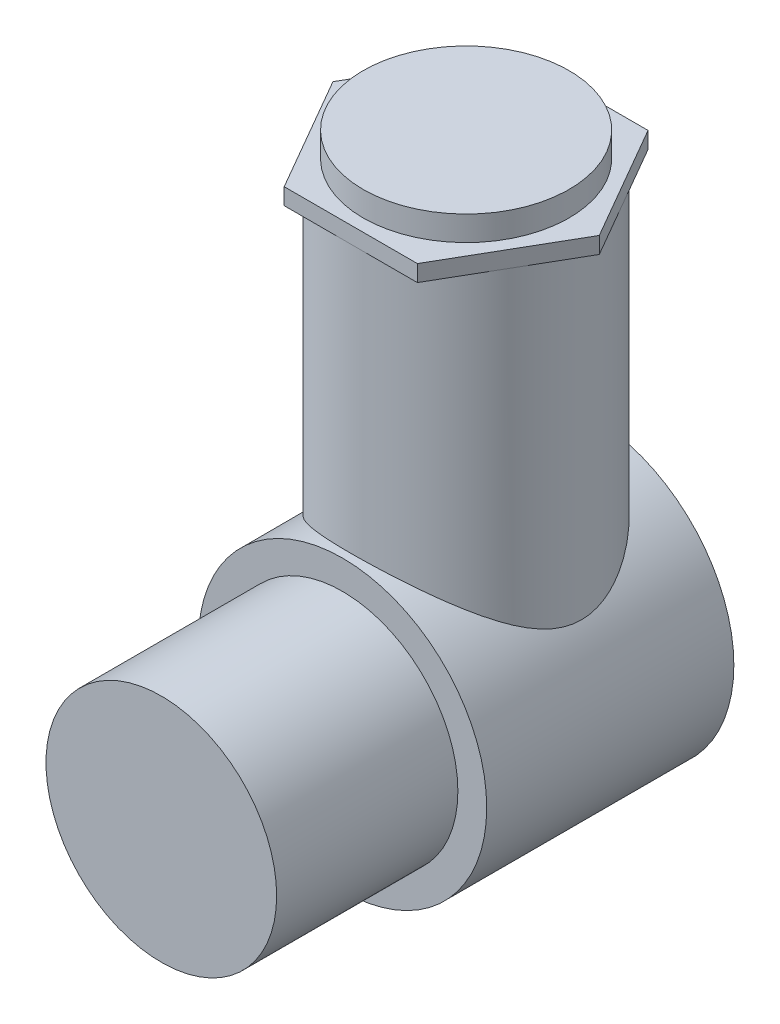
ISO-10303-21;
HEADER;
FILE_DESCRIPTION(('STEP AP214'),'2;1');
FILE_NAME('part.step','',(''),(''),'','','');
FILE_SCHEMA(('AUTOMOTIVE_DESIGN { 1 0 10303 214 1 1 1 1 }'));
ENDSEC;
DATA;
#1=APPLICATION_CONTEXT('core data for automotive mechanical design processes');
#2=APPLICATION_PROTOCOL_DEFINITION('international standard','automotive_design',2000,#1);
#3=PRODUCT_CONTEXT('',#1,'mechanical');
#4=PRODUCT('Part','Part','',(#3));
#5=PRODUCT_RELATED_PRODUCT_CATEGORY('part','',(#4));
#6=PRODUCT_DEFINITION_FORMATION('','',#4);
#7=PRODUCT_DEFINITION_CONTEXT('part definition',#1,'design');
#8=PRODUCT_DEFINITION('design','',#6,#7);
#9=PRODUCT_DEFINITION_SHAPE('','',#8);
#10=(LENGTH_UNIT() NAMED_UNIT(*) SI_UNIT(.MILLI.,.METRE.));
#11=(NAMED_UNIT(*) PLANE_ANGLE_UNIT() SI_UNIT($,.RADIAN.));
#12=(NAMED_UNIT(*) SI_UNIT($,.STERADIAN.) SOLID_ANGLE_UNIT());
#13=UNCERTAINTY_MEASURE_WITH_UNIT(LENGTH_MEASURE(1.E-05),#10,'distance_accuracy_value','');
#14=(GEOMETRIC_REPRESENTATION_CONTEXT(3) GLOBAL_UNCERTAINTY_ASSIGNED_CONTEXT((#13)) GLOBAL_UNIT_ASSIGNED_CONTEXT((#10,
#11,#12)) REPRESENTATION_CONTEXT('',''));
#15=CARTESIAN_POINT('',(0.,0.,0.));
#16=DIRECTION('',(0.,0.,1.));
#17=DIRECTION('',(1.,0.,0.));
#18=AXIS2_PLACEMENT_3D('',#15,#16,#17);
#19=CARTESIAN_POINT('',(0.,0.,150.));
#20=DIRECTION('',(0.,0.,-1.));
#21=DIRECTION('',(-1.,0.,0.));
#22=AXIS2_PLACEMENT_3D('',#19,#20,#21);
#23=CYLINDRICAL_SURFACE('',#22,175.);
#24=CARTESIAN_POINT('',(0.,0.,150.));
#25=DIRECTION('',(0.,0.,1.));
#26=DIRECTION('',(1.,0.,0.));
#27=AXIS2_PLACEMENT_3D('',#24,#25,#26);
#28=CIRCLE('',#27,175.);
#29=CARTESIAN_POINT('',(175.,0.,150.));
#30=VERTEX_POINT('',#29);
#31=EDGE_CURVE('E155',#30,#30,#28,.T.);
#32=ORIENTED_EDGE('',*,*,#31,.F.);
#33=EDGE_LOOP('',(#32));
#34=FACE_BOUND('',#33,.T.);
#35=CARTESIAN_POINT('',(0.,0.,-150.));
#36=DIRECTION('',(0.,0.,1.));
#37=DIRECTION('',(1.,0.,0.));
#38=AXIS2_PLACEMENT_3D('',#35,#36,#37);
#39=CIRCLE('',#38,175.);
#40=CARTESIAN_POINT('',(175.,0.,-150.));
#41=VERTEX_POINT('',#40);
#42=EDGE_CURVE('E151',#41,#41,#39,.T.);
#43=ORIENTED_EDGE('',*,*,#42,.T.);
#44=EDGE_LOOP('',(#43));
#45=FACE_BOUND('',#44,.T.);
#46=CARTESIAN_POINT('',(0.,175.,-140.));
#47=CARTESIAN_POINT('',(-1.68080300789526,174.999998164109,-139.999998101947));
#48=CARTESIAN_POINT('',(-3.36167422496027,174.975771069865,-139.969717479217));
#49=CARTESIAN_POINT('',(-6.72004292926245,174.878997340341,-139.848721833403));
#50=CARTESIAN_POINT('',(-8.39753991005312,174.806443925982,-139.757998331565));
#51=CARTESIAN_POINT('',(-11.7462356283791,174.61340139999,-139.51646936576));
#52=CARTESIAN_POINT('',(-13.4174310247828,174.492889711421,-139.365635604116));
#53=CARTESIAN_POINT('',(-16.7492251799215,174.204648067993,-139.004572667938));
#54=CARTESIAN_POINT('',(-18.4098243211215,174.036919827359,-138.794345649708));
#55=CARTESIAN_POINT('',(-21.7203796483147,173.654849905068,-138.314959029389));
#56=CARTESIAN_POINT('',(-23.3703092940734,173.440419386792,-138.04568710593));
#57=CARTESIAN_POINT('',(-26.6531920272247,172.966349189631,-137.449592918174));
#58=CARTESIAN_POINT('',(-28.2861449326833,172.706709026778,-137.122770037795));
#59=CARTESIAN_POINT('',(-31.53193351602,172.143689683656,-136.412963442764));
#60=CARTESIAN_POINT('',(-33.1447718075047,171.84031625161,-136.02998710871));
#61=CARTESIAN_POINT('',(-36.3478712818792,171.191420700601,-135.209339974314));
#62=CARTESIAN_POINT('',(-37.9381325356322,170.845898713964,-134.771669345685));
#63=CARTESIAN_POINT('',(-41.0834344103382,170.116844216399,-133.846260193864));
#64=CARTESIAN_POINT('',(-42.6386364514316,169.733572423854,-133.358864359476));
#65=CARTESIAN_POINT('',(-45.7223867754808,168.92898761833,-132.333306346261));
#66=CARTESIAN_POINT('',(-47.250932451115,168.507670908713,-131.79513923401));
#67=CARTESIAN_POINT('',(-50.2791715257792,167.62902571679,-130.669865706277));
#68=CARTESIAN_POINT('',(-51.7788679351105,167.171701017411,-130.082764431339));
#69=CARTESIAN_POINT('',(-54.7480602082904,166.222980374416,-128.861271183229));
#70=CARTESIAN_POINT('',(-56.2175534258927,165.731581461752,-128.226875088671));
#71=CARTESIAN_POINT('',(-59.1243339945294,164.71697581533,-126.912790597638));
#72=CARTESIAN_POINT('',(-60.561631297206,164.193779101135,-126.233116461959));
#73=CARTESIAN_POINT('',(-63.4034220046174,163.117487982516,-124.829954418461));
#74=CARTESIAN_POINT('',(-64.8079124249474,162.564390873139,-124.106462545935));
#75=CARTESIAN_POINT('',(-67.5830067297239,161.430430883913,-122.61735982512));
#76=CARTESIAN_POINT('',(-68.9536093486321,160.849566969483,-121.851747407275));
#77=CARTESIAN_POINT('',(-71.6600682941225,159.66220139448,-120.280021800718));
#78=CARTESIAN_POINT('',(-72.9959233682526,159.055698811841,-119.473907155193));
#79=CARTESIAN_POINT('',(-76.0913887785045,157.603787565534,-117.535094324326));
#80=CARTESIAN_POINT('',(-77.8365284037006,156.748747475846,-116.386443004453));
#81=CARTESIAN_POINT('',(-81.2611345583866,155.00104585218,-114.021746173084));
#82=CARTESIAN_POINT('',(-82.9405967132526,154.10838182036,-112.805696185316));
#83=CARTESIAN_POINT('',(-86.2333082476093,152.290361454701,-110.309049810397));
#84=CARTESIAN_POINT('',(-87.8465399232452,151.364996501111,-109.028436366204));
#85=CARTESIAN_POINT('',(-91.0056433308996,149.486954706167,-106.40576831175));
#86=CARTESIAN_POINT('',(-92.5515161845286,148.534278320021,-105.06371472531));
#87=CARTESIAN_POINT('',(-95.5794864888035,146.604207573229,-102.316915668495));
#88=CARTESIAN_POINT('',(-97.0614048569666,145.626754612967,-100.912014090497));
#89=CARTESIAN_POINT('',(-99.9567992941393,143.654816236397,-98.0448335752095));
#90=CARTESIAN_POINT('',(-101.370275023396,142.660330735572,-96.5825543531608));
#91=CARTESIAN_POINT('',(-104.128324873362,140.659851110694,-93.6024225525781));
#92=CARTESIAN_POINT('',(-105.472907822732,139.653858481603,-92.0845771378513));
#93=CARTESIAN_POINT('',(-108.093069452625,137.635833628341,-88.9943375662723));
#94=CARTESIAN_POINT('',(-109.368648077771,136.623801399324,-87.4219433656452));
#95=CARTESIAN_POINT('',(-111.869836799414,134.583745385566,-84.198375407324));
#96=CARTESIAN_POINT('',(-113.094352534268,133.555719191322,-82.5463538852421));
#97=CARTESIAN_POINT('',(-115.471235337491,131.506107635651,-79.1872914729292));
#98=CARTESIAN_POINT('',(-116.623601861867,130.484522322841,-77.4802501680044));
#99=CARTESIAN_POINT('',(-118.855725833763,128.454633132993,-74.0106281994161));
#100=CARTESIAN_POINT('',(-119.935458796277,127.446333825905,-72.2480290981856));
#101=CARTESIAN_POINT('',(-122.020717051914,125.451291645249,-68.6675802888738));
#102=CARTESIAN_POINT('',(-123.026243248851,124.464548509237,-66.8497312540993));
#103=CARTESIAN_POINT('',(-124.958865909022,122.52408614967,-63.1632898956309));
#104=CARTESIAN_POINT('',(-125.886169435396,121.570283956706,-61.2948500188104));
#105=CARTESIAN_POINT('',(-127.663361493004,119.702663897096,-57.5017634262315));
#106=CARTESIAN_POINT('',(-128.513246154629,118.788848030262,-55.5771139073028));
#107=CARTESIAN_POINT('',(-130.132278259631,117.012960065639,-51.6725606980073));
#108=CARTESIAN_POINT('',(-130.901482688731,116.150851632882,-49.6926972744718));
#109=CARTESIAN_POINT('',(-132.356330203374,114.490263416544,-45.676710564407));
#110=CARTESIAN_POINT('',(-133.04198830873,113.69177220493,-43.6405974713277));
#111=CARTESIAN_POINT('',(-134.422147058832,112.057997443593,-39.2028779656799));
#112=CARTESIAN_POINT('',(-135.10255475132,111.23515288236,-36.7922501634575));
#113=CARTESIAN_POINT('',(-136.340408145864,109.714429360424,-31.9006744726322));
#114=CARTESIAN_POINT('',(-136.897873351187,109.016530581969,-29.4197378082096));
#115=CARTESIAN_POINT('',(-137.635338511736,108.081775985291,-25.654366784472));
#116=CARTESIAN_POINT('',(-137.86453674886,107.789094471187,-24.3931132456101));
#117=CARTESIAN_POINT('',(-138.289361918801,107.243517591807,-21.8564732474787));
#118=CARTESIAN_POINT('',(-138.4849923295,106.990618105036,-20.5810882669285));
#119=CARTESIAN_POINT('',(-138.84176494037,106.5272258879,-18.0177420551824));
#120=CARTESIAN_POINT('',(-139.00290467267,106.316736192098,-16.7297799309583));
#121=CARTESIAN_POINT('',(-139.289832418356,105.940542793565,-14.1433877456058));
#122=CARTESIAN_POINT('',(-139.415620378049,105.774839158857,-12.8449576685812));
#123=CARTESIAN_POINT('',(-139.632092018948,105.4889159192,-10.2282810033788));
#124=CARTESIAN_POINT('',(-139.722450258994,105.369118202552,-8.90996117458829));
#125=CARTESIAN_POINT('',(-139.865885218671,105.178649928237,-6.26774170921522));
#126=CARTESIAN_POINT('',(-139.918961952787,105.107979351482,-4.94384207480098));
#127=CARTESIAN_POINT('',(-139.987491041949,105.016692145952,-2.2933930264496));
#128=CARTESIAN_POINT('',(-140.002944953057,104.996073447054,-0.966843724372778));
#129=CARTESIAN_POINT('',(-139.99613153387,105.005157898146,1.68598659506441));
#130=CARTESIAN_POINT('',(-139.973864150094,105.034861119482,3.01226761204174));
#131=CARTESIAN_POINT('',(-139.891724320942,105.144234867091,5.66254597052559));
#132=CARTESIAN_POINT('',(-139.83182491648,105.223941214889,6.98654099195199));
#133=CARTESIAN_POINT('',(-139.674780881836,105.432312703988,9.62843162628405));
#134=CARTESIAN_POINT('',(-139.577636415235,105.560977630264,10.9463272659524));
#135=CARTESIAN_POINT('',(-139.346685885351,105.86565841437,13.5735101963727));
#136=CARTESIAN_POINT('',(-139.212876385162,106.041678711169,14.882796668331));
#137=CARTESIAN_POINT('',(-138.909365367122,106.438952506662,17.4903193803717));
#138=CARTESIAN_POINT('',(-138.739662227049,106.660208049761,18.7885551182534));
#139=CARTESIAN_POINT('',(-138.335979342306,107.183405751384,21.5739331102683));
#140=CARTESIAN_POINT('',(-138.09609811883,107.492554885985,23.0588696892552));
#141=CARTESIAN_POINT('',(-137.571055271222,108.163700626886,26.0086403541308));
#142=CARTESIAN_POINT('',(-137.285891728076,108.525699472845,27.4734735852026));
#143=CARTESIAN_POINT('',(-136.671839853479,109.297993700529,30.3811831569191));
#144=CARTESIAN_POINT('',(-136.342947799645,109.708293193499,31.82405761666));
#145=CARTESIAN_POINT('',(-135.643011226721,110.572523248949,34.6863783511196));
#146=CARTESIAN_POINT('',(-135.271961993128,111.02645869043,36.1058219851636));
#147=CARTESIAN_POINT('',(-134.096026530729,112.448966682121,40.333948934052));
#148=CARTESIAN_POINT('',(-133.22970975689,113.476509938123,43.1060520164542));
#149=CARTESIAN_POINT('',(-131.344544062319,115.65328781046,48.5479943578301));
#150=CARTESIAN_POINT('',(-130.325682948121,116.802532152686,51.2178254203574));
#151=CARTESIAN_POINT('',(-128.42141115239,118.888175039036,55.7890107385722));
#152=CARTESIAN_POINT('',(-127.567981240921,119.804352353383,57.7130902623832));
#153=CARTESIAN_POINT('',(-125.783502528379,121.676548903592,61.505304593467));
#154=CARTESIAN_POINT('',(-124.852445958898,122.632572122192,63.3734337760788));
#155=CARTESIAN_POINT('',(-122.914525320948,124.574887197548,67.0548144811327));
#156=CARTESIAN_POINT('',(-121.907632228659,125.56119055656,68.8680446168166));
#157=CARTESIAN_POINT('',(-119.819938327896,127.554952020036,72.4393565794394));
#158=CARTESIAN_POINT('',(-118.739139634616,128.562409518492,74.1974399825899));
#159=CARTESIAN_POINT('',(-116.503454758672,130.591833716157,77.6607892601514));
#160=CARTESIAN_POINT('',(-115.348483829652,131.613815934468,79.3659912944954));
#161=CARTESIAN_POINT('',(-112.966394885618,133.663993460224,82.7213806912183));
#162=CARTESIAN_POINT('',(-111.739276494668,134.692188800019,84.3715677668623));
#163=CARTESIAN_POINT('',(-109.213677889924,136.748029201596,87.6161990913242));
#164=CARTESIAN_POINT('',(-107.91520968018,137.775674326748,89.2106526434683));
#165=CARTESIAN_POINT('',(-105.247124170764,139.824432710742,92.3432496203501));
#166=CARTESIAN_POINT('',(-103.877506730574,140.845545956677,93.8813929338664));
#167=CARTESIAN_POINT('',(-101.029751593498,142.902612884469,96.940562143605));
#168=CARTESIAN_POINT('',(-99.5496889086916,143.938230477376,98.4600235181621));
#169=CARTESIAN_POINT('',(-96.5151774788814,145.990326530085,101.436370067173));
#170=CARTESIAN_POINT('',(-94.9607282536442,147.006804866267,102.893254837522));
#171=CARTESIAN_POINT('',(-91.7775386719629,149.014849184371,105.742359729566));
#172=CARTESIAN_POINT('',(-90.1487848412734,150.006410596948,107.134568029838));
#173=CARTESIAN_POINT('',(-86.8178254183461,151.958519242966,109.851189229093));
#174=CARTESIAN_POINT('',(-85.1156216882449,152.919067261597,111.175603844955));
#175=CARTESIAN_POINT('',(-81.6424328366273,154.801181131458,113.75049796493));
#176=CARTESIAN_POINT('',(-79.8716114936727,155.722830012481,115.001137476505));
#177=CARTESIAN_POINT('',(-76.258671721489,157.523613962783,117.42806607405));
#178=CARTESIAN_POINT('',(-74.4165515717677,158.402748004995,118.604353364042));
#179=CARTESIAN_POINT('',(-70.6633639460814,160.112272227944,120.878042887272));
#180=CARTESIAN_POINT('',(-68.7523224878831,160.942680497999,121.975474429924));
#181=CARTESIAN_POINT('',(-64.8628910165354,162.549165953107,124.087474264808));
#182=CARTESIAN_POINT('',(-62.8845074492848,163.325248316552,125.102050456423));
#183=CARTESIAN_POINT('',(-59.4416008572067,164.602644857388,126.764452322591));
#184=CARTESIAN_POINT('',(-57.9929296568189,165.118790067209,127.433836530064));
#185=CARTESIAN_POINT('',(-55.0641143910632,166.118443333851,128.726474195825));
#186=CARTESIAN_POINT('',(-53.5839717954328,166.601952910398,129.349729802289));
#187=CARTESIAN_POINT('',(-50.5938587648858,167.534216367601,130.548287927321));
#188=CARTESIAN_POINT('',(-49.083892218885,167.982974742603,131.123596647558));
#189=CARTESIAN_POINT('',(-46.0356301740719,168.843800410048,132.224607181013));
#190=CARTESIAN_POINT('',(-44.4973343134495,169.255867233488,132.75030836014));
#191=CARTESIAN_POINT('',(-41.3952087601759,170.041157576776,133.750106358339));
#192=CARTESIAN_POINT('',(-39.8313929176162,170.41440140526,134.224230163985));
#193=CARTESIAN_POINT('',(-36.6796488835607,171.12045842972,135.119528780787));
#194=CARTESIAN_POINT('',(-35.0917207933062,171.453271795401,135.540703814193));
#195=CARTESIAN_POINT('',(-31.8941273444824,172.076779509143,136.328559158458));
#196=CARTESIAN_POINT('',(-30.2844610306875,172.367471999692,136.695237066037));
#197=CARTESIAN_POINT('',(-27.0461508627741,172.905175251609,137.372639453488));
#198=CARTESIAN_POINT('',(-25.4175069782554,173.152185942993,137.683363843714));
#199=CARTESIAN_POINT('',(-22.1354889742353,173.602356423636,138.249078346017));
#200=CARTESIAN_POINT('',(-20.4820295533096,173.805276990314,138.503764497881));
#201=CARTESIAN_POINT('',(-17.1620513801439,174.16443889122,138.954201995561));
#202=CARTESIAN_POINT('',(-15.495532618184,174.320680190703,139.149953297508));
#203=CARTESIAN_POINT('',(-12.1527672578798,174.585570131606,139.481652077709));
#204=CARTESIAN_POINT('',(-10.4765205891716,174.694218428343,139.617599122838));
#205=CARTESIAN_POINT('',(-7.11779098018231,174.863273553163,139.82906877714));
#206=CARTESIAN_POINT('',(-5.43530804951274,174.923680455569,139.904591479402));
#207=CARTESIAN_POINT('',(-2.06790525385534,174.995884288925,139.994857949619));
#208=CARTESIAN_POINT('',(-0.382985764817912,175.007688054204,140.0096102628));
#209=CARTESIAN_POINT('',(2.98593306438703,174.982632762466,139.978290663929));
#210=CARTESIAN_POINT('',(4.66993240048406,174.945773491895,139.932218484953));
#211=CARTESIAN_POINT('',(8.03332891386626,174.823617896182,139.779467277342));
#212=CARTESIAN_POINT('',(9.71272631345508,174.738323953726,139.672791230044));
#213=CARTESIAN_POINT('',(13.0634643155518,174.519811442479,139.399323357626));
#214=CARTESIAN_POINT('',(14.7348050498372,174.386593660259,139.232532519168));
#215=CARTESIAN_POINT('',(17.9307163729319,174.085761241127,138.855551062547));
#216=CARTESIAN_POINT('',(19.456182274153,173.921819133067,138.649985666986));
#217=CARTESIAN_POINT('',(22.4949334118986,173.554948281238,138.18950554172));
#218=CARTESIAN_POINT('',(24.0082186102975,173.35201941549,137.934590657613));
#219=CARTESIAN_POINT('',(27.0200742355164,172.908162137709,137.376348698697));
#220=CARTESIAN_POINT('',(28.518645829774,172.667236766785,137.073025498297));
#221=CARTESIAN_POINT('',(31.498964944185,172.148491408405,136.418997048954));
#222=CARTESIAN_POINT('',(32.9807123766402,171.870671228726,136.068291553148));
#223=CARTESIAN_POINT('',(35.9255061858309,171.279344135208,135.320604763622));
#224=CARTESIAN_POINT('',(37.3885498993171,170.965832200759,134.923616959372));
#225=CARTESIAN_POINT('',(40.2939365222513,170.304487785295,134.084619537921));
#226=CARTESIAN_POINT('',(41.7362778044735,169.956652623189,133.642606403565));
#227=CARTESIAN_POINT('',(44.598365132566,169.228148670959,132.714915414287));
#228=CARTESIAN_POINT('',(46.0181121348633,168.847481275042,132.229239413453));
#229=CARTESIAN_POINT('',(48.8336490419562,168.054794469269,131.21552406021));
#230=CARTESIAN_POINT('',(50.2294368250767,167.642772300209,130.687480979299));
#231=CARTESIAN_POINT('',(53.0808895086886,166.762646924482,129.556606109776));
#232=CARTESIAN_POINT('',(54.53493934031,166.292652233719,128.951170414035));
#233=CARTESIAN_POINT('',(57.4130042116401,165.32106571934,127.695781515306));
#234=CARTESIAN_POINT('',(58.8370165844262,164.819471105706,127.04582438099));
#235=CARTESIAN_POINT('',(63.061882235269,163.270307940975,125.031720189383));
#236=CARTESIAN_POINT('',(65.8161354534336,162.178182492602,123.603112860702));
#237=CARTESIAN_POINT('',(71.1910277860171,159.891743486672,120.587462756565));
#238=CARTESIAN_POINT('',(73.8116828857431,158.697442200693,119.000439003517));
#239=CARTESIAN_POINT('',(78.9151973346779,156.22238895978,115.679129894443));
#240=CARTESIAN_POINT('',(81.3980487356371,154.941632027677,113.944836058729));
#241=CARTESIAN_POINT('',(86.679082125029,152.060563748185,109.998021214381));
#242=CARTESIAN_POINT('',(89.4480661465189,150.445634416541,107.757096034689));
#243=CARTESIAN_POINT('',(94.7837127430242,147.142422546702,103.095107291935));
#244=CARTESIAN_POINT('',(97.3503521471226,145.454131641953,100.674023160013));
#245=CARTESIAN_POINT('',(101.04998778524,142.885144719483,96.9123528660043));
#246=CARTESIAN_POINT('',(102.259787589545,142.021447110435,95.6348447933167));
#247=CARTESIAN_POINT('',(104.627883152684,140.285994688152,93.0381307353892));
#248=CARTESIAN_POINT('',(105.786179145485,139.414239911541,91.7189249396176));
#249=CARTESIAN_POINT('',(108.051018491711,137.666349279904,89.039623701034));
#250=CARTESIAN_POINT('',(109.157561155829,136.790213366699,87.6795277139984));
#251=CARTESIAN_POINT('',(111.318646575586,135.037382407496,84.9189711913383));
#252=CARTESIAN_POINT('',(112.37318877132,134.160687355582,83.518510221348));
#253=CARTESIAN_POINT('',(114.649528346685,132.223938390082,80.3742176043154));
#254=CARTESIAN_POINT('',(115.858966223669,131.16469914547,78.6209125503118));
#255=CARTESIAN_POINT('',(118.199953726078,129.059092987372,75.0554421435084));
#256=CARTESIAN_POINT('',(119.331500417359,128.01272656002,73.2432745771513));
#257=CARTESIAN_POINT('',(121.516068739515,125.940907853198,69.5588557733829));
#258=CARTESIAN_POINT('',(122.569046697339,124.915467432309,67.686571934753));
#259=CARTESIAN_POINT('',(124.594080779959,122.895727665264,63.8823773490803));
#260=CARTESIAN_POINT('',(125.566138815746,121.901427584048,61.950468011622));
#261=CARTESIAN_POINT('',(127.423859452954,119.958161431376,58.0331176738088));
#262=CARTESIAN_POINT('',(128.309811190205,119.009049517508,56.0478865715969));
#263=CARTESIAN_POINT('',(129.996274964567,117.164543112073,52.0167508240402));
#264=CARTESIAN_POINT('',(130.79678110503,116.269152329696,49.9708420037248));
#265=CARTESIAN_POINT('',(132.307814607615,114.546730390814,45.8204505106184));
#266=CARTESIAN_POINT('',(133.01843406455,113.719629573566,43.7160305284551));
#267=CARTESIAN_POINT('',(134.345978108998,112.148188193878,39.4480909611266));
#268=CARTESIAN_POINT('',(134.962926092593,111.403826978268,37.2845862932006));
#269=CARTESIAN_POINT('',(136.141529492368,109.960982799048,32.7325797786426));
#270=CARTESIAN_POINT('',(136.695368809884,109.270339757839,30.3395098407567));
#271=CARTESIAN_POINT('',(137.434861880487,108.336587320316,26.7055796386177));
#272=CARTESIAN_POINT('',(137.666154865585,108.042363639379,25.4868400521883));
#273=CARTESIAN_POINT('',(138.097453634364,107.490539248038,23.035651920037));
#274=CARTESIAN_POINT('',(138.297462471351,107.232934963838,21.8032047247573));
#275=CARTESIAN_POINT('',(138.664944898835,106.757309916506,19.3285945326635));
#276=CARTESIAN_POINT('',(138.832485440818,106.539207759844,18.0864571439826));
#277=CARTESIAN_POINT('',(139.134734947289,106.144182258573,15.5917908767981));
#278=CARTESIAN_POINT('',(139.269447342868,105.967254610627,14.3392630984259));
#279=CARTESIAN_POINT('',(139.505369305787,105.656471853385,11.8256294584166));
#280=CARTESIAN_POINT('',(139.606576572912,105.522619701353,10.5645230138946));
#281=CARTESIAN_POINT('',(139.774914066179,105.299539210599,8.03608687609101));
#282=CARTESIAN_POINT('',(139.842044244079,105.210310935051,6.76875717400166));
#283=CARTESIAN_POINT('',(139.942109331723,105.077176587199,4.2233971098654));
#284=CARTESIAN_POINT('',(139.974855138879,105.033521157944,2.94534613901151));
#285=CARTESIAN_POINT('',(140.005301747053,104.992933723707,0.388083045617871));
#286=CARTESIAN_POINT('',(140.003002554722,104.996001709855,-0.891129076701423));
#287=CARTESIAN_POINT('',(139.963373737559,105.048822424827,-3.4480120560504));
#288=CARTESIAN_POINT('',(139.926044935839,105.098574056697,-4.72568294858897));
#289=CARTESIAN_POINT('',(139.816583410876,105.244150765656,-7.27689534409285));
#290=CARTESIAN_POINT('',(139.744450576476,105.339975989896,-8.5504368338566));
#291=CARTESIAN_POINT('',(139.56568201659,105.576713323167,-11.0926238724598));
#292=CARTESIAN_POINT('',(139.458999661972,105.717686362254,-12.3612604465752));
#293=CARTESIAN_POINT('',(139.211756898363,106.043049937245,-14.8896007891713));
#294=CARTESIAN_POINT('',(139.071196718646,106.227440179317,-16.1493046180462));
#295=CARTESIAN_POINT('',(138.756912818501,106.637638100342,-18.6579008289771));
#296=CARTESIAN_POINT('',(138.583185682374,106.863450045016,-19.90679208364));
#297=CARTESIAN_POINT('',(138.2034067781,107.354154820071,-22.3919340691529));
#298=CARTESIAN_POINT('',(137.997353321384,107.619049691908,-23.6281841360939));
#299=CARTESIAN_POINT('',(137.492993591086,108.263044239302,-26.4236469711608));
#300=CARTESIAN_POINT('',(137.184882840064,108.653544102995,-27.9784852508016));
#301=CARTESIAN_POINT('',(136.519551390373,109.488342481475,-31.0628789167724));
#302=CARTESIAN_POINT('',(136.162327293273,109.9326447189,-32.592432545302));
#303=CARTESIAN_POINT('',(135.019556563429,111.338112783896,-37.1415422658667));
#304=CARTESIAN_POINT('',(134.162920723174,112.371827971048,-40.1214965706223));
#305=CARTESIAN_POINT('',(132.745650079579,114.035635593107,-44.5080209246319));
#306=CARTESIAN_POINT('',(132.250446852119,114.609927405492,-45.9581167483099));
#307=CARTESIAN_POINT('',(131.217368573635,115.791266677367,-48.8295946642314));
#308=CARTESIAN_POINT('',(130.679494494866,116.398313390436,-50.2509774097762));
#309=CARTESIAN_POINT('',(129.562397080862,117.640482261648,-53.0648387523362));
#310=CARTESIAN_POINT('',(128.983173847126,118.275604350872,-54.4573174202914));
#311=CARTESIAN_POINT('',(127.784444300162,119.569703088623,-57.2135842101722));
#312=CARTESIAN_POINT('',(127.164936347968,120.228680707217,-58.577371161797));
#313=CARTESIAN_POINT('',(125.596376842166,121.870254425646,-61.8891323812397));
#314=CARTESIAN_POINT('',(124.625392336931,122.863960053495,-63.8212593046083));
#315=CARTESIAN_POINT('',(122.602486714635,124.882635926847,-67.6259765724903));
#316=CARTESIAN_POINT('',(121.550558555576,125.907608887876,-69.4985617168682));
#317=CARTESIAN_POINT('',(119.367109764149,127.979525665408,-73.1852744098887));
#318=CARTESIAN_POINT('',(118.235561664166,129.026476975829,-74.9993814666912));
#319=CARTESIAN_POINT('',(115.894449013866,131.133354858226,-78.5686428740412));
#320=CARTESIAN_POINT('',(114.684886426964,132.193281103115,-80.3237987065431));
#321=CARTESIAN_POINT('',(112.187372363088,134.319341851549,-83.7767137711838));
#322=CARTESIAN_POINT('',(110.899347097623,135.385481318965,-85.4744165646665));
#323=CARTESIAN_POINT('',(108.246531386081,137.515753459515,-88.8100748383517));
#324=CARTESIAN_POINT('',(106.881740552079,138.579886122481,-90.4480300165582));
#325=CARTESIAN_POINT('',(104.07602174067,140.699226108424,-93.6628673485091));
#326=CARTESIAN_POINT('',(102.635105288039,141.75443475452,-95.2397586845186));
#327=CARTESIAN_POINT('',(99.6772758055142,143.849662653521,-98.3311597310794));
#328=CARTESIAN_POINT('',(98.1603627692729,144.889681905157,-99.8456694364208));
#329=CARTESIAN_POINT('',(95.0302616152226,146.961964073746,-102.829892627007));
#330=CARTESIAN_POINT('',(93.4160640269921,147.993941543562,-104.298746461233));
#331=CARTESIAN_POINT('',(90.1104254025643,150.029593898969,-107.167628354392));
#332=CARTESIAN_POINT('',(88.4189839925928,151.033268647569,-108.567656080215));
#333=CARTESIAN_POINT('',(84.9591637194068,153.006231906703,-111.29597869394));
#334=CARTESIAN_POINT('',(83.1907693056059,153.975513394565,-112.624258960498));
#335=CARTESIAN_POINT('',(79.5783457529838,155.873183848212,-115.205096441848));
#336=CARTESIAN_POINT('',(77.7343173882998,156.801573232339,-116.457654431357));
#337=CARTESIAN_POINT('',(73.9764950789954,158.608999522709,-118.880037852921));
#338=CARTESIAN_POINT('',(72.062878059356,159.488148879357,-120.050053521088));
#339=CARTESIAN_POINT('',(68.1636053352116,161.193209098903,-122.306158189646));
#340=CARTESIAN_POINT('',(66.1779474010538,162.019118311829,-123.392244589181));
#341=CARTESIAN_POINT('',(62.1383276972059,163.61093795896,-125.475056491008));
#342=CARTESIAN_POINT('',(60.0844016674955,164.376879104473,-126.471827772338));
#343=CARTESIAN_POINT('',(55.9108094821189,165.842912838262,-128.371478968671));
#344=CARTESIAN_POINT('',(53.7911515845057,166.543013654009,-129.274370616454));
#345=CARTESIAN_POINT('',(50.1932664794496,167.654204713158,-130.702189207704));
#346=CARTESIAN_POINT('',(48.7317803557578,168.084977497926,-131.254212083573));
#347=CARTESIAN_POINT('',(45.7825203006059,168.912124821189,-132.311808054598));
#348=CARTESIAN_POINT('',(44.29474757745,169.308500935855,-132.817383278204));
#349=CARTESIAN_POINT('',(41.2947290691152,170.065100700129,-133.78051897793));
#350=CARTESIAN_POINT('',(39.7824842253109,170.425325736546,-134.23808129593));
#351=CARTESIAN_POINT('',(36.7354378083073,171.107992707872,-135.103723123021));
#352=CARTESIAN_POINT('',(35.2006360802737,171.430434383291,-135.511802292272));
#353=CARTESIAN_POINT('',(32.1141671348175,172.035309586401,-136.276198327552));
#354=CARTESIAN_POINT('',(30.5625454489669,172.317831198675,-136.632629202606));
#355=CARTESIAN_POINT('',(27.4414914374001,172.842322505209,-137.293513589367));
#356=CARTESIAN_POINT('',(25.8720594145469,173.084292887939,-137.597967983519));
#357=CARTESIAN_POINT('',(22.7185435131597,173.526372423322,-138.15364725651));
#358=CARTESIAN_POINT('',(21.1344651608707,173.726496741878,-138.404891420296));
#359=CARTESIAN_POINT('',(17.9540323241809,174.083924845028,-138.853272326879));
#360=CARTESIAN_POINT('',(16.3576793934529,174.241233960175,-139.050415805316));
#361=CARTESIAN_POINT('',(13.5343266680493,174.480162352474,-139.349679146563));
#362=CARTESIAN_POINT('',(12.3092898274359,174.570883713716,-139.463245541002));
#363=CARTESIAN_POINT('',(9.85529393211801,174.72659870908,-139.658110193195));
#364=CARTESIAN_POINT('',(8.6263358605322,174.791598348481,-139.739415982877));
#365=CARTESIAN_POINT('',(6.16534044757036,174.895699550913,-139.869608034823));
#366=CARTESIAN_POINT('',(4.93330250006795,174.934795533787,-139.918487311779));
#367=CARTESIAN_POINT('',(2.46752218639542,174.986949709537,-139.983688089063));
#368=CARTESIAN_POINT('',(1.2337794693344,175.00000134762,-140.00000139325));
#369=CARTESIAN_POINT('',(0.,175.,-140.));
#370=B_SPLINE_CURVE_WITH_KNOTS('',3,(#46,#47,#48,#49,#50,#51,#52,#53,#54,#55,#56,#57,#58,#59,
#60,#61,#62,#63,#64,#65,#66,#67,#68,#69,#70,#71,#72,#73,#74,#75,#76,#77,#78,#79,#80,#81,#82,#83,
#84,#85,#86,#87,#88,#89,#90,#91,#92,#93,#94,#95,#96,#97,#98,#99,#100,#101,#102,#103,#104,#105,
#106,#107,#108,#109,#110,#111,#112,#113,#114,#115,#116,#117,#118,#119,#120,#121,#122,#123,#124,
#125,#126,#127,#128,#129,#130,#131,#132,#133,#134,#135,#136,#137,#138,#139,#140,#141,#142,#143,
#144,#145,#146,#147,#148,#149,#150,#151,#152,#153,#154,#155,#156,#157,#158,#159,#160,#161,#162,
#163,#164,#165,#166,#167,#168,#169,#170,#171,#172,#173,#174,#175,#176,#177,#178,#179,#180,#181,
#182,#183,#184,#185,#186,#187,#188,#189,#190,#191,#192,#193,#194,#195,#196,#197,#198,#199,#200,
#201,#202,#203,#204,#205,#206,#207,#208,#209,#210,#211,#212,#213,#214,#215,#216,#217,#218,#219,
#220,#221,#222,#223,#224,#225,#226,#227,#228,#229,#230,#231,#232,#233,#234,#235,#236,#237,#238,
#239,#240,#241,#242,#243,#244,#245,#246,#247,#248,#249,#250,#251,#252,#253,#254,#255,#256,#257,
#258,#259,#260,#261,#262,#263,#264,#265,#266,#267,#268,#269,#270,#271,#272,#273,#274,#275,#276,
#277,#278,#279,#280,#281,#282,#283,#284,#285,#286,#287,#288,#289,#290,#291,#292,#293,#294,#295,
#296,#297,#298,#299,#300,#301,#302,#303,#304,#305,#306,#307,#308,#309,#310,#311,#312,#313,#314,
#315,#316,#317,#318,#319,#320,#321,#322,#323,#324,#325,#326,#327,#328,#329,#330,#331,#332,#333,
#334,#335,#336,#337,#338,#339,#340,#341,#342,#343,#344,#345,#346,#347,#348,#349,#350,#351,#352,
#353,#354,#355,#356,#357,#358,#359,#360,#361,#362,#363,#364,#365,#366,#367,#368,#369),
.UNSPECIFIED.,.T.,.F.,(4,2,2,2,2,2,2,2,2,2,2,2,2,2,2,2,2,2,2,2,2,2,2,2,2,2,2,2,2,2,2,2,2,2,2,2,
2,2,2,2,2,2,2,2,2,2,2,2,2,2,2,2,2,2,2,2,2,2,2,2,2,2,2,2,2,2,2,2,2,2,2,2,2,2,2,2,2,2,2,2,2,2,2,2,
2,2,2,2,2,2,2,2,2,2,2,2,2,2,2,2,2,2,2,2,2,2,2,2,2,2,2,2,2,2,2,2,2,2,2,2,2,2,2,2,2,2,2,2,2,2,2,2,
2,2,2,2,2,2,2,2,2,2,2,2,2,2,2,2,2,2,2,2,2,2,2,2,2,2,2,2,2,4),(0.,5.04208097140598,
10.0848693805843,15.1300345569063,20.1750165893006,25.2296802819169,30.2843980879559,
35.3384521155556,40.3924902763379,45.4137899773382,50.4355780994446,55.4568393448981,
60.4785386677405,65.4986637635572,70.5192437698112,75.5400109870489,80.5609589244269,
87.3307845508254,94.1010603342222,100.873134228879,107.645095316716,114.434928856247,
121.224796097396,128.013791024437,134.802791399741,141.698034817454,148.593330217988,
155.490938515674,162.388462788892,169.26711482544,176.146110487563,183.020214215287,
189.89308029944,197.796597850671,205.698860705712,209.642636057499,213.586002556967,
217.52965111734,221.473305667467,225.452380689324,229.431454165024,233.41036306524,
237.389277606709,241.37104584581,245.352796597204,249.334920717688,253.317224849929,
257.922261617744,262.527493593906,267.133117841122,271.739257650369,280.971710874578,
290.204902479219,297.08939751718,303.974582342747,310.862415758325,317.750052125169,
324.645703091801,331.541389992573,338.435920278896,345.330464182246,352.409852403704,
359.489286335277,366.57000917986,373.650552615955,380.715127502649,387.779872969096,
394.841978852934,401.903410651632,406.933990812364,411.964336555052,416.994030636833,
422.023789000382,427.050902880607,432.077995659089,437.105310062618,442.132632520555,
447.186586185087,452.240543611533,457.294537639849,462.348523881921,467.401799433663,
472.455097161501,477.508146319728,482.561112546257,487.203675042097,491.846252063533,
496.48845769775,501.130687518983,505.773571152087,510.41681774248,515.059867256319,
519.703325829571,524.6331153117,529.563340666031,539.421875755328,549.279228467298,
559.137149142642,570.859884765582,582.58396084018,588.463044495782,594.342101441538,
600.221236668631,606.100435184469,613.234844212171,620.369521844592,627.508136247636,
634.646582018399,641.760163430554,648.874235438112,655.980958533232,663.085903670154,
670.733222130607,674.557140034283,678.38068449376,682.196258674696,686.011433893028,
689.826870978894,693.642313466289,697.478631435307,701.314948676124,705.151175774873,
708.987415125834,712.828853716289,716.670266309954,720.51207472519,724.354083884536,
729.249383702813,734.145022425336,743.936457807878,748.844895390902,753.753221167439,
758.661534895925,763.570048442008,770.70680256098,777.844178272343,784.984028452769,
792.123699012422,799.270190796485,806.416718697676,813.562167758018,820.707617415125,
827.947761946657,835.187941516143,842.429591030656,849.671166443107,856.895466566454,
864.119990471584,871.340789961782,878.560685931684,883.421266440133,888.281624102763,
893.141795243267,898.00199976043,902.851306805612,907.70053151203,912.547995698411,
917.394856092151,921.095090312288,924.794460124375,928.494626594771,932.195724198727),.UNSPECIFIED.);
#371=CARTESIAN_POINT('',(0.,175.,-140.));
#372=VERTEX_POINT('',#371);
#373=EDGE_CURVE('E42',#372,#372,#370,.T.);
#374=ORIENTED_EDGE('',*,*,#373,.F.);
#375=EDGE_LOOP('',(#374));
#376=FACE_BOUND('',#375,.T.);
#377=ADVANCED_FACE('F38',(#34,#45,#376),#23,.T.);
#378=CARTESIAN_POINT('',(0.,0.,150.));
#379=DIRECTION('',(0.,0.,1.));
#380=DIRECTION('',(1.,0.,0.));
#381=AXIS2_PLACEMENT_3D('',#378,#379,#380);
#382=PLANE('',#381);
#383=CARTESIAN_POINT('',(0.,0.,150.));
#384=DIRECTION('',(0.,0.,1.));
#385=DIRECTION('',(1.,0.,0.));
#386=AXIS2_PLACEMENT_3D('',#383,#384,#385);
#387=CIRCLE('',#386,140.);
#388=CARTESIAN_POINT('',(140.,0.,150.));
#389=VERTEX_POINT('',#388);
#390=EDGE_CURVE('E152',#389,#389,#387,.T.);
#391=ORIENTED_EDGE('',*,*,#390,.F.);
#392=EDGE_LOOP('',(#391));
#393=FACE_BOUND('',#392,.T.);
#394=ORIENTED_EDGE('',*,*,#31,.T.);
#395=EDGE_LOOP('',(#394));
#396=FACE_BOUND('',#395,.T.);
#397=ADVANCED_FACE('F165',(#393,#396),#382,.T.);
#398=CARTESIAN_POINT('',(0.,0.,-150.));
#399=DIRECTION('',(0.,0.,1.));
#400=DIRECTION('',(1.,0.,0.));
#401=AXIS2_PLACEMENT_3D('',#398,#399,#400);
#402=PLANE('',#401);
#403=ORIENTED_EDGE('',*,*,#42,.F.);
#404=EDGE_LOOP('',(#403));
#405=FACE_BOUND('',#404,.T.);
#406=ADVANCED_FACE('F162',(#405),#402,.F.);
#407=CARTESIAN_POINT('',(0.,0.,370.));
#408=DIRECTION('',(0.,0.,-1.));
#409=DIRECTION('',(-1.,0.,0.));
#410=AXIS2_PLACEMENT_3D('',#407,#408,#409);
#411=CYLINDRICAL_SURFACE('',#410,140.);
#412=CARTESIAN_POINT('',(0.,0.,370.));
#413=DIRECTION('',(0.,0.,1.));
#414=DIRECTION('',(1.,0.,0.));
#415=AXIS2_PLACEMENT_3D('',#412,#413,#414);
#416=CIRCLE('',#415,140.);
#417=CARTESIAN_POINT('',(140.,0.,370.));
#418=VERTEX_POINT('',#417);
#419=EDGE_CURVE('E147',#418,#418,#416,.T.);
#420=ORIENTED_EDGE('',*,*,#419,.F.);
#421=EDGE_LOOP('',(#420));
#422=FACE_BOUND('',#421,.T.);
#423=ORIENTED_EDGE('',*,*,#390,.T.);
#424=EDGE_LOOP('',(#423));
#425=FACE_BOUND('',#424,.T.);
#426=ADVANCED_FACE('F164',(#422,#425),#411,.T.);
#427=CARTESIAN_POINT('',(0.,0.,370.));
#428=DIRECTION('',(0.,0.,1.));
#429=DIRECTION('',(1.,0.,0.));
#430=AXIS2_PLACEMENT_3D('',#427,#428,#429);
#431=PLANE('',#430);
#432=ORIENTED_EDGE('',*,*,#419,.T.);
#433=EDGE_LOOP('',(#432));
#434=FACE_BOUND('',#433,.T.);
#435=ADVANCED_FACE('F170',(#434),#431,.T.);
#436=CARTESIAN_POINT('',(0.,500.,0.));
#437=DIRECTION('',(0.,-1.,0.));
#438=DIRECTION('',(0.,0.,-1.));
#439=AXIS2_PLACEMENT_3D('',#436,#437,#438);
#440=CYLINDRICAL_SURFACE('',#439,140.);
#441=CARTESIAN_POINT('',(0.,500.,0.));
#442=DIRECTION('',(0.,1.,0.));
#443=DIRECTION('',(0.,0.,1.));
#444=AXIS2_PLACEMENT_3D('',#441,#442,#443);
#445=CIRCLE('',#444,140.);
#446=CARTESIAN_POINT('',(0.,500.,140.));
#447=VERTEX_POINT('',#446);
#448=CARTESIAN_POINT('',(121.243556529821,500.,70.));
#449=VERTEX_POINT('',#448);
#450=EDGE_CURVE('E141',#447,#449,#445,.T.);
#451=ORIENTED_EDGE('',*,*,#450,.F.);
#452=CARTESIAN_POINT('',(-121.243556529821,500.,70.));
#453=VERTEX_POINT('',#452);
#454=EDGE_CURVE('E58',#453,#447,#445,.T.);
#455=ORIENTED_EDGE('',*,*,#454,.F.);
#456=CARTESIAN_POINT('',(-121.243556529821,500.,-70.));
#457=VERTEX_POINT('',#456);
#458=EDGE_CURVE('E62',#457,#453,#445,.T.);
#459=ORIENTED_EDGE('',*,*,#458,.F.);
#460=CARTESIAN_POINT('',(0.,500.,-140.));
#461=VERTEX_POINT('',#460);
#462=EDGE_CURVE('E386',#461,#457,#445,.T.);
#463=ORIENTED_EDGE('',*,*,#462,.F.);
#464=CARTESIAN_POINT('',(121.243556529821,500.,-70.));
#465=VERTEX_POINT('',#464);
#466=EDGE_CURVE('E394',#465,#461,#445,.T.);
#467=ORIENTED_EDGE('',*,*,#466,.F.);
#468=EDGE_CURVE('E148',#449,#465,#445,.T.);
#469=ORIENTED_EDGE('',*,*,#468,.F.);
#470=EDGE_LOOP('',(#451,#455,#459,#463,#467,#469));
#471=FACE_BOUND('',#470,.T.);
#472=ORIENTED_EDGE('',*,*,#373,.T.);
#473=EDGE_LOOP('',(#472));
#474=FACE_BOUND('',#473,.T.);
#475=ADVANCED_FACE('F189',(#471,#474),#440,.T.);
#476=CARTESIAN_POINT('',(0.,500.,0.));
#477=DIRECTION('',(0.,1.,0.));
#478=DIRECTION('',(0.,0.,1.));
#479=AXIS2_PLACEMENT_3D('',#476,#477,#478);
#480=PLANE('',#479);
#481=DIRECTION('',(1.,0.,0.));
#482=VECTOR('',#481,1.);
#483=CARTESIAN_POINT('',(-80.8290376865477,500.,140.));
#484=LINE('',#483,#482);
#485=CARTESIAN_POINT('',(80.8290376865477,500.,140.));
#486=VERTEX_POINT('',#485);
#487=EDGE_CURVE('E366',#447,#486,#484,.T.);
#488=ORIENTED_EDGE('',*,*,#487,.F.);
#489=ORIENTED_EDGE('',*,*,#450,.T.);
#490=DIRECTION('',(0.5,0.,-0.866025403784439));
#491=VECTOR('',#490,1.);
#492=CARTESIAN_POINT('',(80.8290376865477,500.,140.));
#493=LINE('',#492,#491);
#494=EDGE_CURVE('E132',#486,#449,#493,.T.);
#495=ORIENTED_EDGE('',*,*,#494,.F.);
#496=EDGE_LOOP('',(#488,#489,#495));
#497=FACE_BOUND('',#496,.T.);
#498=ADVANCED_FACE('F193',(#497),#480,.F.);
#499=CARTESIAN_POINT('',(161.658075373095,500.,0.));
#500=VERTEX_POINT('',#499);
#501=EDGE_CURVE('E370',#449,#500,#493,.T.);
#502=ORIENTED_EDGE('',*,*,#501,.F.);
#503=ORIENTED_EDGE('',*,*,#468,.T.);
#504=DIRECTION('',(-0.5,0.,-0.866025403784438));
#505=VECTOR('',#504,1.);
#506=CARTESIAN_POINT('',(161.658075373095,500.,0.));
#507=LINE('',#506,#505);
#508=EDGE_CURVE('E345',#500,#465,#507,.T.);
#509=ORIENTED_EDGE('',*,*,#508,.F.);
#510=EDGE_LOOP('',(#502,#503,#509));
#511=FACE_BOUND('',#510,.T.);
#512=ADVANCED_FACE('F199',(#511),#480,.F.);
#513=CARTESIAN_POINT('',(80.8290376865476,500.,-140.));
#514=VERTEX_POINT('',#513);
#515=EDGE_CURVE('E137',#465,#514,#507,.T.);
#516=ORIENTED_EDGE('',*,*,#515,.F.);
#517=ORIENTED_EDGE('',*,*,#466,.T.);
#518=DIRECTION('',(-1.,0.,0.));
#519=VECTOR('',#518,1.);
#520=CARTESIAN_POINT('',(80.8290376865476,500.,-140.));
#521=LINE('',#520,#519);
#522=EDGE_CURVE('E356',#514,#461,#521,.T.);
#523=ORIENTED_EDGE('',*,*,#522,.F.);
#524=EDGE_LOOP('',(#516,#517,#523));
#525=FACE_BOUND('',#524,.T.);
#526=ADVANCED_FACE('F209',(#525),#480,.F.);
#527=CARTESIAN_POINT('',(-80.8290376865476,500.,-140.));
#528=VERTEX_POINT('',#527);
#529=EDGE_CURVE('E355',#461,#528,#521,.T.);
#530=ORIENTED_EDGE('',*,*,#529,.F.);
#531=ORIENTED_EDGE('',*,*,#462,.T.);
#532=DIRECTION('',(-0.5,0.,0.866025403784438));
#533=VECTOR('',#532,1.);
#534=CARTESIAN_POINT('',(-80.8290376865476,500.,-140.));
#535=LINE('',#534,#533);
#536=EDGE_CURVE('E359',#528,#457,#535,.T.);
#537=ORIENTED_EDGE('',*,*,#536,.F.);
#538=EDGE_LOOP('',(#530,#531,#537));
#539=FACE_BOUND('',#538,.T.);
#540=ADVANCED_FACE('F217',(#539),#480,.F.);
#541=CARTESIAN_POINT('',(-161.658075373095,500.,0.));
#542=VERTEX_POINT('',#541);
#543=EDGE_CURVE('E358',#457,#542,#535,.T.);
#544=ORIENTED_EDGE('',*,*,#543,.F.);
#545=ORIENTED_EDGE('',*,*,#458,.T.);
#546=DIRECTION('',(0.5,0.,0.866025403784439));
#547=VECTOR('',#546,1.);
#548=CARTESIAN_POINT('',(-161.658075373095,500.,0.));
#549=LINE('',#548,#547);
#550=EDGE_CURVE('E363',#542,#453,#549,.T.);
#551=ORIENTED_EDGE('',*,*,#550,.F.);
#552=EDGE_LOOP('',(#544,#545,#551));
#553=FACE_BOUND('',#552,.T.);
#554=ADVANCED_FACE('F225',(#553),#480,.F.);
#555=CARTESIAN_POINT('',(-80.8290376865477,500.,140.));
#556=VERTEX_POINT('',#555);
#557=EDGE_CURVE('E362',#453,#556,#549,.T.);
#558=ORIENTED_EDGE('',*,*,#557,.F.);
#559=ORIENTED_EDGE('',*,*,#454,.T.);
#560=EDGE_CURVE('E367',#556,#447,#484,.T.);
#561=ORIENTED_EDGE('',*,*,#560,.F.);
#562=EDGE_LOOP('',(#558,#559,#561));
#563=FACE_BOUND('',#562,.T.);
#564=ADVANCED_FACE('F202',(#563),#480,.F.);
#565=CARTESIAN_POINT('',(161.658075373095,520.,0.));
#566=DIRECTION('',(-0.866025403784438,0.,0.5));
#567=DIRECTION('',(0.5,0.,0.866025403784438));
#568=AXIS2_PLACEMENT_3D('',#565,#566,#567);
#569=PLANE('',#568);
#570=ORIENTED_EDGE('',*,*,#508,.T.);
#571=ORIENTED_EDGE('',*,*,#515,.T.);
#572=DIRECTION('',(0.,-1.,0.));
#573=VECTOR('',#572,1.);
#574=CARTESIAN_POINT('',(80.8290376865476,520.,-140.));
#575=LINE('',#574,#573);
#576=CARTESIAN_POINT('',(80.8290376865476,520.,-140.));
#577=VERTEX_POINT('',#576);
#578=EDGE_CURVE('E117',#577,#514,#575,.T.);
#579=ORIENTED_EDGE('',*,*,#578,.F.);
#580=DIRECTION('',(-0.5,0.,-0.866025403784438));
#581=VECTOR('',#580,1.);
#582=CARTESIAN_POINT('',(161.658075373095,520.,0.));
#583=LINE('',#582,#581);
#584=CARTESIAN_POINT('',(161.658075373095,520.,0.));
#585=VERTEX_POINT('',#584);
#586=EDGE_CURVE('E123',#585,#577,#583,.T.);
#587=ORIENTED_EDGE('',*,*,#586,.F.);
#588=DIRECTION('',(0.,-1.,0.));
#589=VECTOR('',#588,1.);
#590=CARTESIAN_POINT('',(161.658075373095,520.,0.));
#591=LINE('',#590,#589);
#592=EDGE_CURVE('E353',#585,#500,#591,.T.);
#593=ORIENTED_EDGE('',*,*,#592,.T.);
#594=EDGE_LOOP('',(#570,#571,#579,#587,#593));
#595=FACE_BOUND('',#594,.T.);
#596=ADVANCED_FACE('F135',(#595),#569,.F.);
#597=CARTESIAN_POINT('',(80.8290376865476,520.,-140.));
#598=DIRECTION('',(0.,0.,1.));
#599=DIRECTION('',(1.,0.,0.));
#600=AXIS2_PLACEMENT_3D('',#597,#598,#599);
#601=PLANE('',#600);
#602=ORIENTED_EDGE('',*,*,#522,.T.);
#603=ORIENTED_EDGE('',*,*,#529,.T.);
#604=DIRECTION('',(0.,-1.,0.));
#605=VECTOR('',#604,1.);
#606=CARTESIAN_POINT('',(-80.8290376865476,520.,-140.));
#607=LINE('',#606,#605);
#608=CARTESIAN_POINT('',(-80.8290376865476,520.,-140.));
#609=VERTEX_POINT('',#608);
#610=EDGE_CURVE('E119',#609,#528,#607,.T.);
#611=ORIENTED_EDGE('',*,*,#610,.F.);
#612=DIRECTION('',(-1.,0.,0.));
#613=VECTOR('',#612,1.);
#614=CARTESIAN_POINT('',(80.8290376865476,520.,-140.));
#615=LINE('',#614,#613);
#616=EDGE_CURVE('E112',#577,#609,#615,.T.);
#617=ORIENTED_EDGE('',*,*,#616,.F.);
#618=ORIENTED_EDGE('',*,*,#578,.T.);
#619=EDGE_LOOP('',(#602,#603,#611,#617,#618));
#620=FACE_BOUND('',#619,.T.);
#621=ADVANCED_FACE('F115',(#620),#601,.F.);
#622=CARTESIAN_POINT('',(-80.8290376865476,520.,-140.));
#623=DIRECTION('',(0.866025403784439,0.,0.5));
#624=DIRECTION('',(0.5,0.,-0.866025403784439));
#625=AXIS2_PLACEMENT_3D('',#622,#623,#624);
#626=PLANE('',#625);
#627=ORIENTED_EDGE('',*,*,#536,.T.);
#628=ORIENTED_EDGE('',*,*,#543,.T.);
#629=DIRECTION('',(0.,-1.,0.));
#630=VECTOR('',#629,1.);
#631=CARTESIAN_POINT('',(-161.658075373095,520.,0.));
#632=LINE('',#631,#630);
#633=CARTESIAN_POINT('',(-161.658075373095,520.,0.));
#634=VERTEX_POINT('',#633);
#635=EDGE_CURVE('E142',#634,#542,#632,.T.);
#636=ORIENTED_EDGE('',*,*,#635,.F.);
#637=DIRECTION('',(-0.5,0.,0.866025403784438));
#638=VECTOR('',#637,1.);
#639=CARTESIAN_POINT('',(-80.8290376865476,520.,-140.));
#640=LINE('',#639,#638);
#641=EDGE_CURVE('E122',#609,#634,#640,.T.);
#642=ORIENTED_EDGE('',*,*,#641,.F.);
#643=ORIENTED_EDGE('',*,*,#610,.T.);
#644=EDGE_LOOP('',(#627,#628,#636,#642,#643));
#645=FACE_BOUND('',#644,.T.);
#646=ADVANCED_FACE('F254',(#645),#626,.F.);
#647=CARTESIAN_POINT('',(-161.658075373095,520.,0.));
#648=DIRECTION('',(0.866025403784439,0.,-0.5));
#649=DIRECTION('',(-0.5,0.,-0.866025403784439));
#650=AXIS2_PLACEMENT_3D('',#647,#648,#649);
#651=PLANE('',#650);
#652=ORIENTED_EDGE('',*,*,#550,.T.);
#653=ORIENTED_EDGE('',*,*,#557,.T.);
#654=DIRECTION('',(0.,-1.,0.));
#655=VECTOR('',#654,1.);
#656=CARTESIAN_POINT('',(-80.8290376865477,520.,140.));
#657=LINE('',#656,#655);
#658=CARTESIAN_POINT('',(-80.8290376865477,520.,140.));
#659=VERTEX_POINT('',#658);
#660=EDGE_CURVE('E377',#659,#556,#657,.T.);
#661=ORIENTED_EDGE('',*,*,#660,.F.);
#662=DIRECTION('',(0.5,0.,0.866025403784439));
#663=VECTOR('',#662,1.);
#664=CARTESIAN_POINT('',(-161.658075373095,520.,0.));
#665=LINE('',#664,#663);
#666=EDGE_CURVE('E349',#634,#659,#665,.T.);
#667=ORIENTED_EDGE('',*,*,#666,.F.);
#668=ORIENTED_EDGE('',*,*,#635,.T.);
#669=EDGE_LOOP('',(#652,#653,#661,#667,#668));
#670=FACE_BOUND('',#669,.T.);
#671=ADVANCED_FACE('F262',(#670),#651,.F.);
#672=CARTESIAN_POINT('',(-80.8290376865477,520.,140.));
#673=DIRECTION('',(0.,0.,-1.));
#674=DIRECTION('',(-1.,0.,0.));
#675=AXIS2_PLACEMENT_3D('',#672,#673,#674);
#676=PLANE('',#675);
#677=ORIENTED_EDGE('',*,*,#560,.T.);
#678=ORIENTED_EDGE('',*,*,#487,.T.);
#679=DIRECTION('',(0.,-1.,0.));
#680=VECTOR('',#679,1.);
#681=CARTESIAN_POINT('',(80.8290376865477,520.,140.));
#682=LINE('',#681,#680);
#683=CARTESIAN_POINT('',(80.8290376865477,520.,140.));
#684=VERTEX_POINT('',#683);
#685=EDGE_CURVE('E374',#684,#486,#682,.T.);
#686=ORIENTED_EDGE('',*,*,#685,.F.);
#687=DIRECTION('',(1.,0.,0.));
#688=VECTOR('',#687,1.);
#689=CARTESIAN_POINT('',(-80.8290376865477,520.,140.));
#690=LINE('',#689,#688);
#691=EDGE_CURVE('E351',#659,#684,#690,.T.);
#692=ORIENTED_EDGE('',*,*,#691,.F.);
#693=ORIENTED_EDGE('',*,*,#660,.T.);
#694=EDGE_LOOP('',(#677,#678,#686,#692,#693));
#695=FACE_BOUND('',#694,.T.);
#696=ADVANCED_FACE('F271',(#695),#676,.F.);
#697=CARTESIAN_POINT('',(80.8290376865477,520.,140.));
#698=DIRECTION('',(-0.866025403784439,0.,-0.5));
#699=DIRECTION('',(-0.5,0.,0.866025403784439));
#700=AXIS2_PLACEMENT_3D('',#697,#698,#699);
#701=PLANE('',#700);
#702=ORIENTED_EDGE('',*,*,#494,.T.);
#703=ORIENTED_EDGE('',*,*,#501,.T.);
#704=ORIENTED_EDGE('',*,*,#592,.F.);
#705=DIRECTION('',(0.5,0.,-0.866025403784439));
#706=VECTOR('',#705,1.);
#707=CARTESIAN_POINT('',(80.8290376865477,520.,140.));
#708=LINE('',#707,#706);
#709=EDGE_CURVE('E128',#684,#585,#708,.T.);
#710=ORIENTED_EDGE('',*,*,#709,.F.);
#711=ORIENTED_EDGE('',*,*,#685,.T.);
#712=EDGE_LOOP('',(#702,#703,#704,#710,#711));
#713=FACE_BOUND('',#712,.T.);
#714=ADVANCED_FACE('F280',(#713),#701,.F.);
#715=CARTESIAN_POINT('',(0.,520.,0.));
#716=DIRECTION('',(0.,1.,0.));
#717=DIRECTION('',(0.,0.,1.));
#718=AXIS2_PLACEMENT_3D('',#715,#716,#717);
#719=PLANE('',#718);
#720=CARTESIAN_POINT('',(0.,520.,0.));
#721=DIRECTION('',(0.,1.,0.));
#722=DIRECTION('',(0.,0.,1.));
#723=AXIS2_PLACEMENT_3D('',#720,#721,#722);
#724=CIRCLE('',#723,125.);
#725=CARTESIAN_POINT('',(0.,520.,125.));
#726=VERTEX_POINT('',#725);
#727=EDGE_CURVE('E11',#726,#726,#724,.T.);
#728=ORIENTED_EDGE('',*,*,#727,.F.);
#729=EDGE_LOOP('',(#728));
#730=FACE_BOUND('',#729,.T.);
#731=ORIENTED_EDGE('',*,*,#586,.T.);
#732=ORIENTED_EDGE('',*,*,#616,.T.);
#733=ORIENTED_EDGE('',*,*,#641,.T.);
#734=ORIENTED_EDGE('',*,*,#666,.T.);
#735=ORIENTED_EDGE('',*,*,#691,.T.);
#736=ORIENTED_EDGE('',*,*,#709,.T.);
#737=EDGE_LOOP('',(#731,#732,#733,#734,#735,#736));
#738=FACE_BOUND('',#737,.T.);
#739=ADVANCED_FACE('F126',(#730,#738),#719,.T.);
#740=CARTESIAN_POINT('',(0.,550.,0.));
#741=DIRECTION('',(0.,-1.,0.));
#742=DIRECTION('',(0.,0.,-1.));
#743=AXIS2_PLACEMENT_3D('',#740,#741,#742);
#744=CYLINDRICAL_SURFACE('',#743,125.);
#745=CARTESIAN_POINT('',(0.,550.,0.));
#746=DIRECTION('',(0.,1.,0.));
#747=DIRECTION('',(0.,0.,1.));
#748=AXIS2_PLACEMENT_3D('',#745,#746,#747);
#749=CIRCLE('',#748,125.);
#750=CARTESIAN_POINT('',(0.,550.,125.));
#751=VERTEX_POINT('',#750);
#752=EDGE_CURVE('E343',#751,#751,#749,.T.);
#753=ORIENTED_EDGE('',*,*,#752,.F.);
#754=EDGE_LOOP('',(#753));
#755=FACE_BOUND('',#754,.T.);
#756=ORIENTED_EDGE('',*,*,#727,.T.);
#757=EDGE_LOOP('',(#756));
#758=FACE_BOUND('',#757,.T.);
#759=ADVANCED_FACE('F297',(#755,#758),#744,.T.);
#760=CARTESIAN_POINT('',(0.,550.,0.));
#761=DIRECTION('',(0.,1.,0.));
#762=DIRECTION('',(0.,0.,1.));
#763=AXIS2_PLACEMENT_3D('',#760,#761,#762);
#764=PLANE('',#763);
#765=ORIENTED_EDGE('',*,*,#752,.T.);
#766=EDGE_LOOP('',(#765));
#767=FACE_BOUND('',#766,.T.);
#768=ADVANCED_FACE('F306',(#767),#764,.T.);
#769=CLOSED_SHELL('',(#377,#397,#406,#426,#435,#475,#498,#512,#526,#540,#554,#564,#596,#621,
#646,#671,#696,#714,#739,#759,#768));
#770=MANIFOLD_SOLID_BREP('B2',#769);
#771=ADVANCED_BREP_SHAPE_REPRESENTATION('',(#18,#770),#14);
#772=SHAPE_DEFINITION_REPRESENTATION(#9,#771);
ENDSEC;
END-ISO-10303-21;
